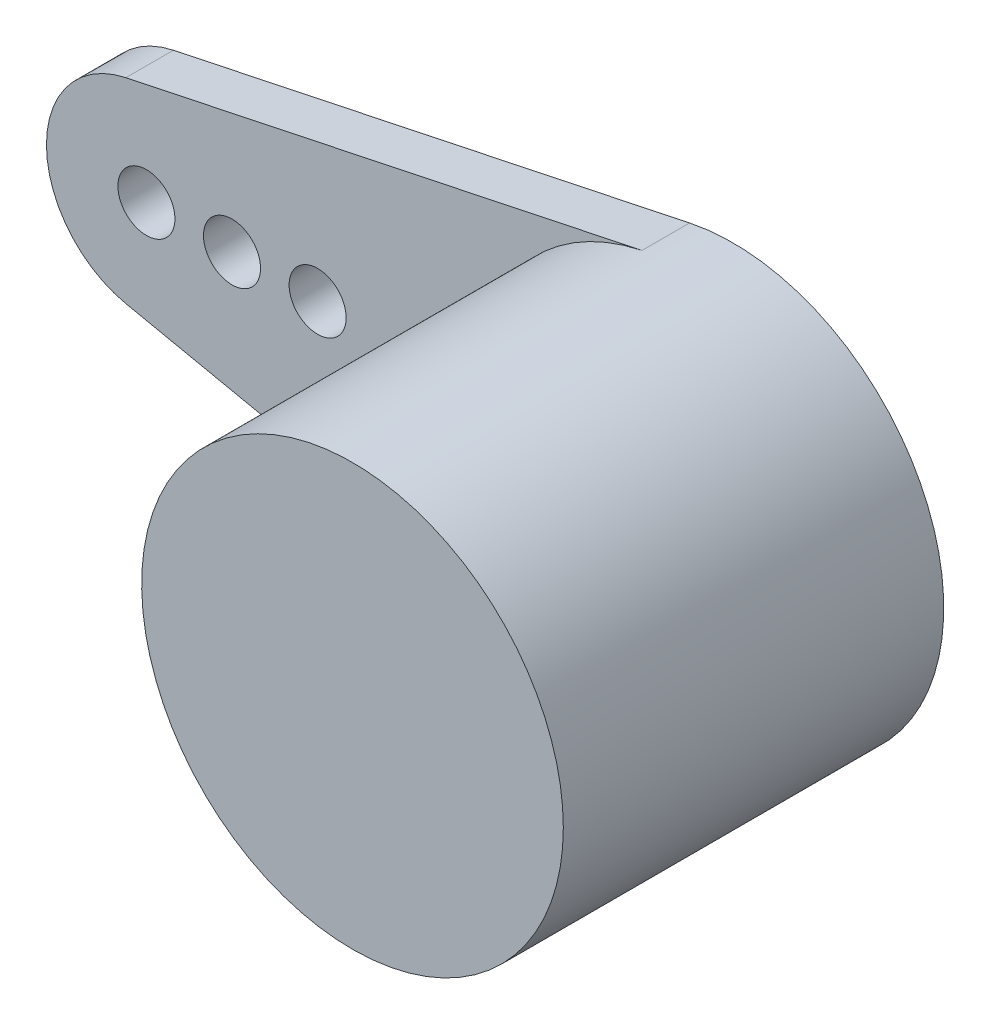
from build123d import *

# Parameters (mm, degrees)
ESQUISSE1_R        = 6.65
BOSS_EXTRU_1_DEPTH = 12
ESQUISSE2_R        = 0.9
BOSS_EXTRU_2_DEPTH = 1.5


with BuildPart() as part:
    # Esquisse1 → Boss.-Extru.1 (new body)
    with BuildSketch(Plane.XY):
        Circle(ESQUISSE1_R)
    extrude(amount=BOSS_EXTRU_1_DEPTH)

    # Esquisse2 → Boss.-Extru.2 (add)
    with BuildSketch(Plane(origin=(0, 0, 0), x_dir=(-1, 0, 0), z_dir=(0, 0, -1))):
        with BuildLine():
            Line((1.36769723, 6.50783407), (17.648603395, 3.086211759))
            ThreePointArc((17.648603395, 3.086211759), (20.153631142, 0), (17.648603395, -3.086211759))
            Line((17.648603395, -3.086211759), (1.36769723, -6.50783407))
            ThreePointArc((1.36769723, -6.50783407), (-6.65, 0), (1.36769723, 6.50783407))
        make_face()
        with Locations((11.6, 0)):
            Circle(ESQUISSE2_R, mode=Mode.SUBTRACT)
        with Locations((14.3, 0)):
            Circle(ESQUISSE2_R, mode=Mode.SUBTRACT)
        with Locations((17, 0)):
            Circle(ESQUISSE2_R, mode=Mode.SUBTRACT)
    extrude(amount=-BOSS_EXTRU_2_DEPTH)


solid = part.part
